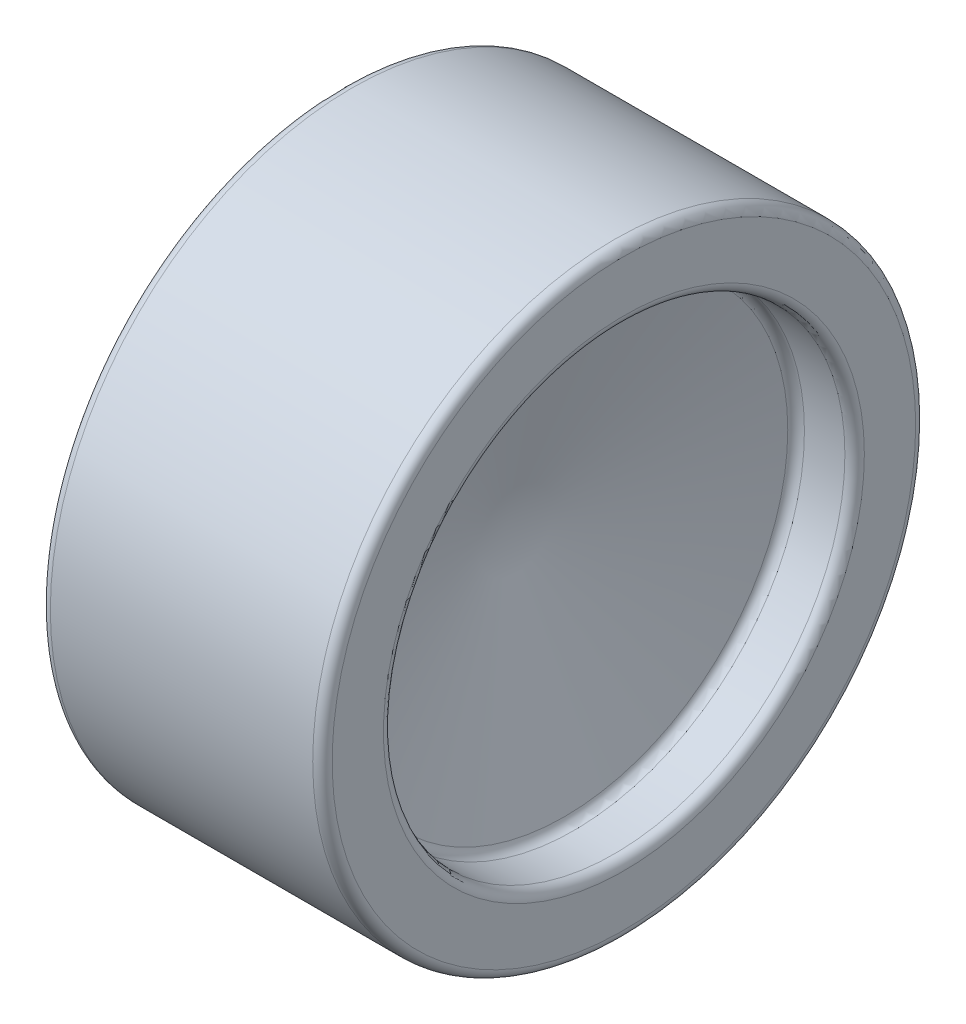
from build123d import *

# Parameters (mm, degrees)
SKETCH1_R      = 310.007
EXTRUDE1_DEPTH = 289.814
SKETCH2_W      = 95.469010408
SKETCH2_H      = 131.065291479
FILLET1_R      = 10


with BuildPart() as part:
    # Sketch1 → Extrude1 (new body)
    with BuildSketch(Plane(origin=(0, 0, 0), x_dir=(0, 0, -1), z_dir=(1, 0, 0))):
        Circle(SKETCH1_R)
    extrude(amount=EXTRUDE1_DEPTH)

    # Sketch2 → Cut-Revolve1 (revolve, cut)
    with BuildSketch(Plane(origin=(0, 0, 0), x_dir=(1, 0, 0), z_dir=(0, 1, 0))):
        Polygon((168.484601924, 0), (230.478047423, 237.249495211), (289.814, 237.249495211), (289.814, 0), align=None)
        with Locations((47.734505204, 171.716849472)):
            Rectangle(SKETCH2_W, SKETCH2_H)
    revolve(axis=Axis((289.814, 0, 0), (-1, 0, 0)), mode=Mode.SUBTRACT)

    # Fillet1
    fillet1_edges = [part.edges().sort_by_distance(p)[0] for p in [
        (0, 0, 310.007),
        (289.814, 0, 310.007),
        (289.814, 0, 237.249495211),
        (230.478047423, 0, 237.249495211),
        (0, 0, 106.184203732),
        (95.469010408, 0, 106.184203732),
        (95.469010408, 0, 237.249495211),
        (0, 0, 237.249495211),
    ]]
    fillet(fillet1_edges, radius=FILLET1_R)


solid = part.part
